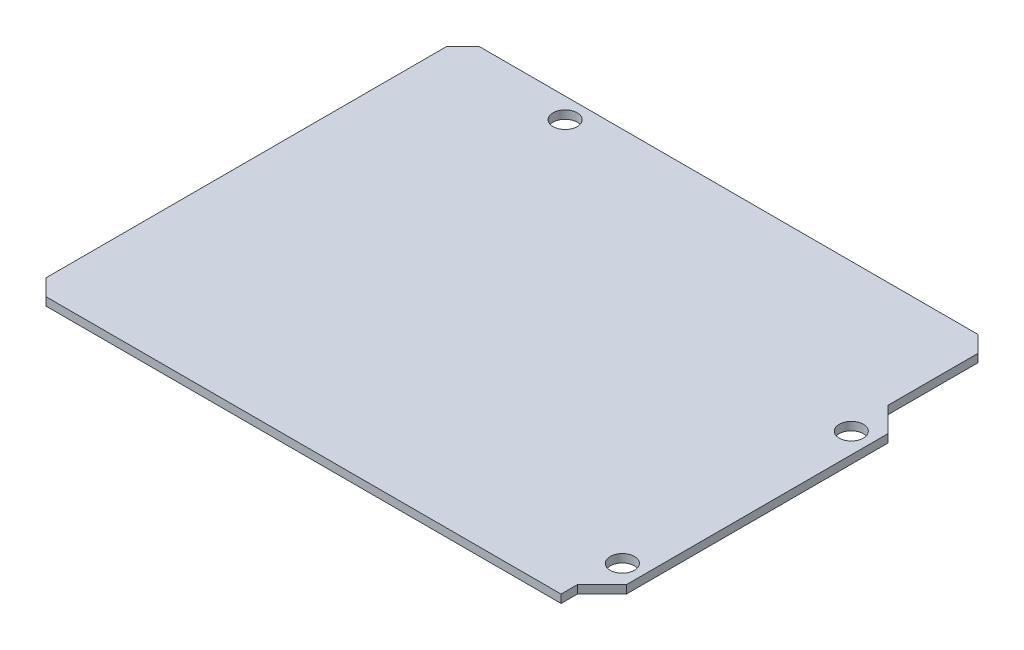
ISO-10303-21;
HEADER;
FILE_DESCRIPTION(('STEP AP214'),'2;1');
FILE_NAME('part.step','',(''),(''),'','','');
FILE_SCHEMA(('AUTOMOTIVE_DESIGN { 1 0 10303 214 1 1 1 1 }'));
ENDSEC;
DATA;
#1=APPLICATION_CONTEXT('core data for automotive mechanical design processes');
#2=APPLICATION_PROTOCOL_DEFINITION('international standard','automotive_design',2000,#1);
#3=PRODUCT_CONTEXT('',#1,'mechanical');
#4=PRODUCT('Part','Part','',(#3));
#5=PRODUCT_RELATED_PRODUCT_CATEGORY('part','',(#4));
#6=PRODUCT_DEFINITION_FORMATION('','',#4);
#7=PRODUCT_DEFINITION_CONTEXT('part definition',#1,'design');
#8=PRODUCT_DEFINITION('design','',#6,#7);
#9=PRODUCT_DEFINITION_SHAPE('','',#8);
#10=(LENGTH_UNIT() NAMED_UNIT(*) SI_UNIT(.MILLI.,.METRE.));
#11=(NAMED_UNIT(*) PLANE_ANGLE_UNIT() SI_UNIT($,.RADIAN.));
#12=(NAMED_UNIT(*) SI_UNIT($,.STERADIAN.) SOLID_ANGLE_UNIT());
#13=UNCERTAINTY_MEASURE_WITH_UNIT(LENGTH_MEASURE(1.E-05),#10,'distance_accuracy_value','');
#14=(GEOMETRIC_REPRESENTATION_CONTEXT(3) GLOBAL_UNCERTAINTY_ASSIGNED_CONTEXT((#13)) GLOBAL_UNIT_ASSIGNED_CONTEXT((#10,
#11,#12)) REPRESENTATION_CONTEXT('',''));
#15=CARTESIAN_POINT('',(0.,0.,0.));
#16=DIRECTION('',(0.,0.,1.));
#17=DIRECTION('',(1.,0.,0.));
#18=AXIS2_PLACEMENT_3D('',#15,#16,#17);
#19=CARTESIAN_POINT('',(-34.,1.,-26.5));
#20=DIRECTION('',(1.,0.,0.));
#21=DIRECTION('',(0.,0.,-1.));
#22=AXIS2_PLACEMENT_3D('',#19,#20,#21);
#23=PLANE('',#22);
#24=DIRECTION('',(0.,0.,1.));
#25=VECTOR('',#24,1.);
#26=CARTESIAN_POINT('',(-34.,0.,-26.5));
#27=LINE('',#26,#25);
#28=CARTESIAN_POINT('',(-34.,0.,-24.5));
#29=VERTEX_POINT('',#28);
#30=CARTESIAN_POINT('',(-34.,0.,24.5));
#31=VERTEX_POINT('',#30);
#32=EDGE_CURVE('E164',#29,#31,#27,.T.);
#33=ORIENTED_EDGE('',*,*,#32,.T.);
#34=DIRECTION('',(0.,1.,0.));
#35=VECTOR('',#34,1.);
#36=CARTESIAN_POINT('',(-34.,1.,24.5));
#37=LINE('',#36,#35);
#38=CARTESIAN_POINT('',(-34.,1.,24.5));
#39=VERTEX_POINT('',#38);
#40=EDGE_CURVE('E193',#31,#39,#37,.T.);
#41=ORIENTED_EDGE('',*,*,#40,.T.);
#42=DIRECTION('',(0.,0.,1.));
#43=VECTOR('',#42,1.);
#44=CARTESIAN_POINT('',(-34.,1.,-26.5));
#45=LINE('',#44,#43);
#46=CARTESIAN_POINT('',(-34.,1.,-24.5));
#47=VERTEX_POINT('',#46);
#48=EDGE_CURVE('E165',#47,#39,#45,.T.);
#49=ORIENTED_EDGE('',*,*,#48,.F.);
#50=DIRECTION('',(0.,-1.,0.));
#51=VECTOR('',#50,1.);
#52=CARTESIAN_POINT('',(-34.,1.,-24.5));
#53=LINE('',#52,#51);
#54=EDGE_CURVE('E190',#47,#29,#53,.T.);
#55=ORIENTED_EDGE('',*,*,#54,.T.);
#56=EDGE_LOOP('',(#33,#41,#49,#55));
#57=FACE_BOUND('',#56,.T.);
#58=ADVANCED_FACE('F38',(#57),#23,.F.);
#59=CARTESIAN_POINT('',(-34.,1.,26.5));
#60=DIRECTION('',(0.,0.,-1.));
#61=DIRECTION('',(-1.,0.,0.));
#62=AXIS2_PLACEMENT_3D('',#59,#60,#61);
#63=PLANE('',#62);
#64=DIRECTION('',(1.,0.,0.));
#65=VECTOR('',#64,1.);
#66=CARTESIAN_POINT('',(-34.,1.,26.5));
#67=LINE('',#66,#65);
#68=CARTESIAN_POINT('',(-32.,1.,26.5));
#69=VERTEX_POINT('',#68);
#70=CARTESIAN_POINT('',(31.,1.,26.5));
#71=VERTEX_POINT('',#70);
#72=EDGE_CURVE('E167',#69,#71,#67,.T.);
#73=ORIENTED_EDGE('',*,*,#72,.F.);
#74=DIRECTION('',(0.,-1.,0.));
#75=VECTOR('',#74,1.);
#76=CARTESIAN_POINT('',(-32.,1.,26.5));
#77=LINE('',#76,#75);
#78=CARTESIAN_POINT('',(-32.,0.,26.5));
#79=VERTEX_POINT('',#78);
#80=EDGE_CURVE('E173',#69,#79,#77,.T.);
#81=ORIENTED_EDGE('',*,*,#80,.T.);
#82=DIRECTION('',(1.,0.,0.));
#83=VECTOR('',#82,1.);
#84=CARTESIAN_POINT('',(-34.,0.,26.5));
#85=LINE('',#84,#83);
#86=CARTESIAN_POINT('',(31.,0.,26.5));
#87=VERTEX_POINT('',#86);
#88=EDGE_CURVE('E176',#79,#87,#85,.T.);
#89=ORIENTED_EDGE('',*,*,#88,.T.);
#90=DIRECTION('',(0.,1.,0.));
#91=VECTOR('',#90,1.);
#92=CARTESIAN_POINT('',(31.,-0.000999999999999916,26.5));
#93=LINE('',#92,#91);
#94=EDGE_CURVE('E156',#87,#71,#93,.T.);
#95=ORIENTED_EDGE('',*,*,#94,.T.);
#96=EDGE_LOOP('',(#73,#81,#89,#95));
#97=FACE_BOUND('',#96,.T.);
#98=ADVANCED_FACE('F223',(#97),#63,.F.);
#99=CARTESIAN_POINT('',(34.,1.,-26.5));
#100=DIRECTION('',(-1.,0.,0.));
#101=DIRECTION('',(0.,0.,1.));
#102=AXIS2_PLACEMENT_3D('',#99,#100,#101);
#103=PLANE('',#102);
#104=DIRECTION('',(0.,0.,-1.));
#105=VECTOR('',#104,1.);
#106=CARTESIAN_POINT('',(34.,0.,-26.5));
#107=LINE('',#106,#105);
#108=CARTESIAN_POINT('',(34.,0.,21.5));
#109=VERTEX_POINT('',#108);
#110=CARTESIAN_POINT('',(34.,0.,-10.5));
#111=VERTEX_POINT('',#110);
#112=EDGE_CURVE('E178',#109,#111,#107,.T.);
#113=ORIENTED_EDGE('',*,*,#112,.T.);
#114=DIRECTION('',(0.,1.,0.));
#115=VECTOR('',#114,1.);
#116=CARTESIAN_POINT('',(34.,-0.000999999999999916,-10.5));
#117=LINE('',#116,#115);
#118=CARTESIAN_POINT('',(34.,1.,-10.5));
#119=VERTEX_POINT('',#118);
#120=EDGE_CURVE('E135',#111,#119,#117,.T.);
#121=ORIENTED_EDGE('',*,*,#120,.T.);
#122=DIRECTION('',(0.,0.,-1.));
#123=VECTOR('',#122,1.);
#124=CARTESIAN_POINT('',(34.,1.,-26.5));
#125=LINE('',#124,#123);
#126=CARTESIAN_POINT('',(34.,1.,21.5));
#127=VERTEX_POINT('',#126);
#128=EDGE_CURVE('E142',#127,#119,#125,.T.);
#129=ORIENTED_EDGE('',*,*,#128,.F.);
#130=DIRECTION('',(0.,1.,0.));
#131=VECTOR('',#130,1.);
#132=CARTESIAN_POINT('',(34.,-0.000999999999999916,21.5));
#133=LINE('',#132,#131);
#134=EDGE_CURVE('E155',#109,#127,#133,.T.);
#135=ORIENTED_EDGE('',*,*,#134,.F.);
#136=EDGE_LOOP('',(#113,#121,#129,#135));
#137=FACE_BOUND('',#136,.T.);
#138=ADVANCED_FACE('F229',(#137),#103,.F.);
#139=CARTESIAN_POINT('',(-34.,1.,-26.5));
#140=DIRECTION('',(0.,0.,1.));
#141=DIRECTION('',(1.,0.,0.));
#142=AXIS2_PLACEMENT_3D('',#139,#140,#141);
#143=PLANE('',#142);
#144=DIRECTION('',(-1.,0.,0.));
#145=VECTOR('',#144,1.);
#146=CARTESIAN_POINT('',(-34.,0.,-26.5));
#147=LINE('',#146,#145);
#148=CARTESIAN_POINT('',(29.,0.,-26.5));
#149=VERTEX_POINT('',#148);
#150=CARTESIAN_POINT('',(-32.,0.,-26.5));
#151=VERTEX_POINT('',#150);
#152=EDGE_CURVE('E168',#149,#151,#147,.T.);
#153=ORIENTED_EDGE('',*,*,#152,.T.);
#154=DIRECTION('',(0.,1.,0.));
#155=VECTOR('',#154,1.);
#156=CARTESIAN_POINT('',(-32.,1.,-26.5));
#157=LINE('',#156,#155);
#158=CARTESIAN_POINT('',(-32.,1.,-26.5));
#159=VERTEX_POINT('',#158);
#160=EDGE_CURVE('E46',#151,#159,#157,.T.);
#161=ORIENTED_EDGE('',*,*,#160,.T.);
#162=DIRECTION('',(-1.,0.,0.));
#163=VECTOR('',#162,1.);
#164=CARTESIAN_POINT('',(-34.,1.,-26.5));
#165=LINE('',#164,#163);
#166=CARTESIAN_POINT('',(29.,1.,-26.5));
#167=VERTEX_POINT('',#166);
#168=EDGE_CURVE('E171',#167,#159,#165,.T.);
#169=ORIENTED_EDGE('',*,*,#168,.F.);
#170=DIRECTION('',(0.,-1.,0.));
#171=VECTOR('',#170,1.);
#172=CARTESIAN_POINT('',(29.,1.,-26.5));
#173=LINE('',#172,#171);
#174=EDGE_CURVE('E200',#167,#149,#173,.T.);
#175=ORIENTED_EDGE('',*,*,#174,.T.);
#176=EDGE_LOOP('',(#153,#161,#169,#175));
#177=FACE_BOUND('',#176,.T.);
#178=ADVANCED_FACE('F203',(#177),#143,.F.);
#179=CARTESIAN_POINT('',(-34.,1.,26.5));
#180=DIRECTION('',(0.,1.,0.));
#181=DIRECTION('',(0.,0.,1.));
#182=AXIS2_PLACEMENT_3D('',#179,#180,#181);
#183=PLANE('',#182);
#184=CARTESIAN_POINT('',(31.5,1.,19.5));
#185=DIRECTION('',(0.,1.,0.));
#186=DIRECTION('',(0.,0.,1.));
#187=AXIS2_PLACEMENT_3D('',#184,#185,#186);
#188=CIRCLE('',#187,1.47319999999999);
#189=CARTESIAN_POINT('',(31.5,1.,20.9732));
#190=VERTEX_POINT('',#189);
#191=EDGE_CURVE('E275',#190,#190,#188,.T.);
#192=ORIENTED_EDGE('',*,*,#191,.F.);
#193=EDGE_LOOP('',(#192));
#194=FACE_BOUND('',#193,.T.);
#195=CARTESIAN_POINT('',(31.5,1.,-8.50000000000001));
#196=DIRECTION('',(0.,1.,0.));
#197=DIRECTION('',(0.,0.,1.));
#198=AXIS2_PLACEMENT_3D('',#195,#196,#197);
#199=CIRCLE('',#198,1.47319999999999);
#200=CARTESIAN_POINT('',(31.5,1.,-7.02680000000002));
#201=VERTEX_POINT('',#200);
#202=EDGE_CURVE('E269',#201,#201,#199,.T.);
#203=ORIENTED_EDGE('',*,*,#202,.F.);
#204=EDGE_LOOP('',(#203));
#205=FACE_BOUND('',#204,.T.);
#206=CARTESIAN_POINT('',(-19.,1.,-24.));
#207=DIRECTION('',(0.,1.,0.));
#208=DIRECTION('',(0.,0.,1.));
#209=AXIS2_PLACEMENT_3D('',#206,#207,#208);
#210=CIRCLE('',#209,1.47319999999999);
#211=CARTESIAN_POINT('',(-19.,1.,-22.5268));
#212=VERTEX_POINT('',#211);
#213=EDGE_CURVE('E263',#212,#212,#210,.T.);
#214=ORIENTED_EDGE('',*,*,#213,.F.);
#215=EDGE_LOOP('',(#214));
#216=FACE_BOUND('',#215,.T.);
#217=ORIENTED_EDGE('',*,*,#48,.T.);
#218=DIRECTION('',(-0.707106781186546,0.,-0.707106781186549));
#219=VECTOR('',#218,1.);
#220=CARTESIAN_POINT('',(-33.,1.,25.5));
#221=LINE('',#220,#219);
#222=EDGE_CURVE('E198',#39,#69,#221,.F.);
#223=ORIENTED_EDGE('',*,*,#222,.T.);
#224=ORIENTED_EDGE('',*,*,#72,.T.);
#225=DIRECTION('',(0.,0.,1.));
#226=VECTOR('',#225,1.);
#227=CARTESIAN_POINT('',(31.,1.,26.5));
#228=LINE('',#227,#226);
#229=CARTESIAN_POINT('',(31.,1.,24.5));
#230=VERTEX_POINT('',#229);
#231=EDGE_CURVE('E152',#230,#71,#228,.T.);
#232=ORIENTED_EDGE('',*,*,#231,.F.);
#233=DIRECTION('',(-0.707106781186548,0.,0.707106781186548));
#234=VECTOR('',#233,1.);
#235=CARTESIAN_POINT('',(34.,1.,21.5));
#236=LINE('',#235,#234);
#237=EDGE_CURVE('E149',#127,#230,#236,.T.);
#238=ORIENTED_EDGE('',*,*,#237,.F.);
#239=ORIENTED_EDGE('',*,*,#128,.T.);
#240=DIRECTION('',(0.707106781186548,0.,0.707106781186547));
#241=VECTOR('',#240,1.);
#242=CARTESIAN_POINT('',(34.,1.,-10.5));
#243=LINE('',#242,#241);
#244=CARTESIAN_POINT('',(31.,1.,-13.5));
#245=VERTEX_POINT('',#244);
#246=EDGE_CURVE('E128',#245,#119,#243,.T.);
#247=ORIENTED_EDGE('',*,*,#246,.F.);
#248=DIRECTION('',(0.,0.,1.));
#249=VECTOR('',#248,1.);
#250=CARTESIAN_POINT('',(31.,1.,-26.5));
#251=LINE('',#250,#249);
#252=CARTESIAN_POINT('',(31.,1.,-24.5));
#253=VERTEX_POINT('',#252);
#254=EDGE_CURVE('E120',#253,#245,#251,.T.);
#255=ORIENTED_EDGE('',*,*,#254,.F.);
#256=DIRECTION('',(0.707106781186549,0.,0.707106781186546));
#257=VECTOR('',#256,1.);
#258=CARTESIAN_POINT('',(23.9999999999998,1.,-31.5000000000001));
#259=LINE('',#258,#257);
#260=EDGE_CURVE('E59',#253,#167,#259,.F.);
#261=ORIENTED_EDGE('',*,*,#260,.T.);
#262=ORIENTED_EDGE('',*,*,#168,.T.);
#263=DIRECTION('',(0.707106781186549,0.,-0.707106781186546));
#264=VECTOR('',#263,1.);
#265=CARTESIAN_POINT('',(-59.5,1.,0.999999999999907));
#266=LINE('',#265,#264);
#267=EDGE_CURVE('E196',#159,#47,#266,.F.);
#268=ORIENTED_EDGE('',*,*,#267,.T.);
#269=EDGE_LOOP('',(#217,#223,#224,#232,#238,#239,#247,#255,#261,#262,#268));
#270=FACE_BOUND('',#269,.T.);
#271=ADVANCED_FACE('F139',(#194,#205,#216,#270),#183,.T.);
#272=CARTESIAN_POINT('',(-34.,0.,26.5));
#273=DIRECTION('',(0.,1.,0.));
#274=DIRECTION('',(0.,0.,1.));
#275=AXIS2_PLACEMENT_3D('',#272,#273,#274);
#276=PLANE('',#275);
#277=CARTESIAN_POINT('',(31.5,0.,19.5));
#278=DIRECTION('',(0.,1.,0.));
#279=DIRECTION('',(0.,0.,1.));
#280=AXIS2_PLACEMENT_3D('',#277,#278,#279);
#281=CIRCLE('',#280,1.47319999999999);
#282=CARTESIAN_POINT('',(31.5,0.,20.9732));
#283=VERTEX_POINT('',#282);
#284=EDGE_CURVE('E272',#283,#283,#281,.T.);
#285=ORIENTED_EDGE('',*,*,#284,.T.);
#286=EDGE_LOOP('',(#285));
#287=FACE_BOUND('',#286,.T.);
#288=CARTESIAN_POINT('',(31.5,0.,-8.50000000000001));
#289=DIRECTION('',(0.,1.,0.));
#290=DIRECTION('',(0.,0.,1.));
#291=AXIS2_PLACEMENT_3D('',#288,#289,#290);
#292=CIRCLE('',#291,1.47319999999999);
#293=CARTESIAN_POINT('',(31.5,0.,-7.02680000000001));
#294=VERTEX_POINT('',#293);
#295=EDGE_CURVE('E266',#294,#294,#292,.T.);
#296=ORIENTED_EDGE('',*,*,#295,.T.);
#297=EDGE_LOOP('',(#296));
#298=FACE_BOUND('',#297,.T.);
#299=CARTESIAN_POINT('',(-19.,0.,-24.));
#300=DIRECTION('',(0.,1.,0.));
#301=DIRECTION('',(0.,0.,1.));
#302=AXIS2_PLACEMENT_3D('',#299,#300,#301);
#303=CIRCLE('',#302,1.47319999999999);
#304=CARTESIAN_POINT('',(-19.,0.,-22.5268));
#305=VERTEX_POINT('',#304);
#306=EDGE_CURVE('E258',#305,#305,#303,.T.);
#307=ORIENTED_EDGE('',*,*,#306,.T.);
#308=EDGE_LOOP('',(#307));
#309=FACE_BOUND('',#308,.T.);
#310=ORIENTED_EDGE('',*,*,#88,.F.);
#311=DIRECTION('',(0.707106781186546,0.,0.707106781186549));
#312=VECTOR('',#311,1.);
#313=CARTESIAN_POINT('',(-32.,0.,26.5));
#314=LINE('',#313,#312);
#315=EDGE_CURVE('E188',#79,#31,#314,.F.);
#316=ORIENTED_EDGE('',*,*,#315,.T.);
#317=ORIENTED_EDGE('',*,*,#32,.F.);
#318=DIRECTION('',(-0.707106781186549,0.,0.707106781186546));
#319=VECTOR('',#318,1.);
#320=CARTESIAN_POINT('',(-34.,0.,-24.5));
#321=LINE('',#320,#319);
#322=EDGE_CURVE('E186',#29,#151,#321,.F.);
#323=ORIENTED_EDGE('',*,*,#322,.T.);
#324=ORIENTED_EDGE('',*,*,#152,.F.);
#325=DIRECTION('',(-0.707106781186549,0.,-0.707106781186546));
#326=VECTOR('',#325,1.);
#327=CARTESIAN_POINT('',(31.,0.,-24.5));
#328=LINE('',#327,#326);
#329=CARTESIAN_POINT('',(31.,0.,-24.5));
#330=VERTEX_POINT('',#329);
#331=EDGE_CURVE('E184',#149,#330,#328,.F.);
#332=ORIENTED_EDGE('',*,*,#331,.T.);
#333=DIRECTION('',(0.,0.,-1.));
#334=VECTOR('',#333,1.);
#335=CARTESIAN_POINT('',(31.,0.,-26.5));
#336=LINE('',#335,#334);
#337=CARTESIAN_POINT('',(31.,0.,-13.5));
#338=VERTEX_POINT('',#337);
#339=EDGE_CURVE('E257',#338,#330,#336,.T.);
#340=ORIENTED_EDGE('',*,*,#339,.F.);
#341=DIRECTION('',(-0.707106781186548,0.,-0.707106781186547));
#342=VECTOR('',#341,1.);
#343=CARTESIAN_POINT('',(34.,0.,-10.5));
#344=LINE('',#343,#342);
#345=EDGE_CURVE('E129',#111,#338,#344,.T.);
#346=ORIENTED_EDGE('',*,*,#345,.F.);
#347=ORIENTED_EDGE('',*,*,#112,.F.);
#348=DIRECTION('',(0.707106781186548,0.,-0.707106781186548));
#349=VECTOR('',#348,1.);
#350=CARTESIAN_POINT('',(34.,0.,21.5));
#351=LINE('',#350,#349);
#352=CARTESIAN_POINT('',(31.,0.,24.5));
#353=VERTEX_POINT('',#352);
#354=EDGE_CURVE('E159',#353,#109,#351,.T.);
#355=ORIENTED_EDGE('',*,*,#354,.F.);
#356=DIRECTION('',(0.,0.,-1.));
#357=VECTOR('',#356,1.);
#358=CARTESIAN_POINT('',(31.,0.,26.5));
#359=LINE('',#358,#357);
#360=EDGE_CURVE('E146',#87,#353,#359,.T.);
#361=ORIENTED_EDGE('',*,*,#360,.F.);
#362=EDGE_LOOP('',(#310,#316,#317,#323,#324,#332,#340,#346,#347,#355,#361));
#363=FACE_BOUND('',#362,.T.);
#364=ADVANCED_FACE('F208',(#287,#298,#309,#363),#276,.F.);
#365=CARTESIAN_POINT('',(31.,-0.000999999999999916,26.5));
#366=DIRECTION('',(-1.,0.,0.));
#367=DIRECTION('',(0.,0.,1.));
#368=AXIS2_PLACEMENT_3D('',#365,#366,#367);
#369=PLANE('',#368);
#370=ORIENTED_EDGE('',*,*,#360,.T.);
#371=DIRECTION('',(0.,1.,0.));
#372=VECTOR('',#371,1.);
#373=CARTESIAN_POINT('',(31.,-0.000999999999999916,24.5));
#374=LINE('',#373,#372);
#375=EDGE_CURVE('E160',#353,#230,#374,.T.);
#376=ORIENTED_EDGE('',*,*,#375,.T.);
#377=ORIENTED_EDGE('',*,*,#231,.T.);
#378=ORIENTED_EDGE('',*,*,#94,.F.);
#379=EDGE_LOOP('',(#370,#376,#377,#378));
#380=FACE_BOUND('',#379,.T.);
#381=ADVANCED_FACE('F249',(#380),#369,.F.);
#382=CARTESIAN_POINT('',(34.,-0.000999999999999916,21.5));
#383=DIRECTION('',(-0.707106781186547,0.,-0.707106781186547));
#384=DIRECTION('',(-0.707106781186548,0.,0.707106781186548));
#385=AXIS2_PLACEMENT_3D('',#382,#383,#384);
#386=PLANE('',#385);
#387=ORIENTED_EDGE('',*,*,#354,.T.);
#388=ORIENTED_EDGE('',*,*,#134,.T.);
#389=ORIENTED_EDGE('',*,*,#237,.T.);
#390=ORIENTED_EDGE('',*,*,#375,.F.);
#391=EDGE_LOOP('',(#387,#388,#389,#390));
#392=FACE_BOUND('',#391,.T.);
#393=ADVANCED_FACE('F255',(#392),#386,.F.);
#394=CARTESIAN_POINT('',(34.,-0.000999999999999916,-10.5));
#395=DIRECTION('',(-0.707106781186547,0.,0.707106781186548));
#396=DIRECTION('',(0.707106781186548,0.,0.707106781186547));
#397=AXIS2_PLACEMENT_3D('',#394,#395,#396);
#398=PLANE('',#397);
#399=ORIENTED_EDGE('',*,*,#345,.T.);
#400=DIRECTION('',(0.,1.,0.));
#401=VECTOR('',#400,1.);
#402=CARTESIAN_POINT('',(31.,-0.000999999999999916,-13.5));
#403=LINE('',#402,#401);
#404=EDGE_CURVE('E124',#338,#245,#403,.T.);
#405=ORIENTED_EDGE('',*,*,#404,.T.);
#406=ORIENTED_EDGE('',*,*,#246,.T.);
#407=ORIENTED_EDGE('',*,*,#120,.F.);
#408=EDGE_LOOP('',(#399,#405,#406,#407));
#409=FACE_BOUND('',#408,.T.);
#410=ADVANCED_FACE('F132',(#409),#398,.F.);
#411=CARTESIAN_POINT('',(31.,-0.000999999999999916,-26.5));
#412=DIRECTION('',(-1.,0.,0.));
#413=DIRECTION('',(0.,0.,1.));
#414=AXIS2_PLACEMENT_3D('',#411,#412,#413);
#415=PLANE('',#414);
#416=ORIENTED_EDGE('',*,*,#339,.T.);
#417=DIRECTION('',(0.,1.,0.));
#418=VECTOR('',#417,1.);
#419=CARTESIAN_POINT('',(31.,-0.000999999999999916,-24.5));
#420=LINE('',#419,#418);
#421=EDGE_CURVE('E11',#330,#253,#420,.T.);
#422=ORIENTED_EDGE('',*,*,#421,.T.);
#423=ORIENTED_EDGE('',*,*,#254,.T.);
#424=ORIENTED_EDGE('',*,*,#404,.F.);
#425=EDGE_LOOP('',(#416,#422,#423,#424));
#426=FACE_BOUND('',#425,.T.);
#427=ADVANCED_FACE('F123',(#426),#415,.F.);
#428=CARTESIAN_POINT('',(-32.,1.,26.5));
#429=DIRECTION('',(0.707106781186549,0.,-0.707106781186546));
#430=DIRECTION('',(-0.707106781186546,0.,-0.707106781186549));
#431=AXIS2_PLACEMENT_3D('',#428,#429,#430);
#432=PLANE('',#431);
#433=ORIENTED_EDGE('',*,*,#222,.F.);
#434=ORIENTED_EDGE('',*,*,#40,.F.);
#435=ORIENTED_EDGE('',*,*,#315,.F.);
#436=ORIENTED_EDGE('',*,*,#80,.F.);
#437=EDGE_LOOP('',(#433,#434,#435,#436));
#438=FACE_BOUND('',#437,.T.);
#439=ADVANCED_FACE('F220',(#438),#432,.F.);
#440=CARTESIAN_POINT('',(-34.,1.,-24.5));
#441=DIRECTION('',(0.707106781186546,0.,0.707106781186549));
#442=DIRECTION('',(0.707106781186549,0.,-0.707106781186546));
#443=AXIS2_PLACEMENT_3D('',#440,#441,#442);
#444=PLANE('',#443);
#445=ORIENTED_EDGE('',*,*,#267,.F.);
#446=ORIENTED_EDGE('',*,*,#160,.F.);
#447=ORIENTED_EDGE('',*,*,#322,.F.);
#448=ORIENTED_EDGE('',*,*,#54,.F.);
#449=EDGE_LOOP('',(#445,#446,#447,#448));
#450=FACE_BOUND('',#449,.T.);
#451=ADVANCED_FACE('F212',(#450),#444,.F.);
#452=CARTESIAN_POINT('',(31.,-0.000999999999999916,-24.5));
#453=DIRECTION('',(-0.707106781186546,0.,0.707106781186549));
#454=DIRECTION('',(0.707106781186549,0.,0.707106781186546));
#455=AXIS2_PLACEMENT_3D('',#452,#453,#454);
#456=PLANE('',#455);
#457=ORIENTED_EDGE('',*,*,#331,.F.);
#458=ORIENTED_EDGE('',*,*,#174,.F.);
#459=ORIENTED_EDGE('',*,*,#260,.F.);
#460=ORIENTED_EDGE('',*,*,#421,.F.);
#461=EDGE_LOOP('',(#457,#458,#459,#460));
#462=FACE_BOUND('',#461,.T.);
#463=ADVANCED_FACE('F40',(#462),#456,.F.);
#464=CARTESIAN_POINT('',(-19.,1.,-24.));
#465=DIRECTION('',(0.,1.,0.));
#466=DIRECTION('',(0.,0.,1.));
#467=AXIS2_PLACEMENT_3D('',#464,#465,#466);
#468=CYLINDRICAL_SURFACE('',#467,1.47319999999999);
#469=ORIENTED_EDGE('',*,*,#306,.F.);
#470=EDGE_LOOP('',(#469));
#471=FACE_BOUND('',#470,.T.);
#472=ORIENTED_EDGE('',*,*,#213,.T.);
#473=EDGE_LOOP('',(#472));
#474=FACE_BOUND('',#473,.T.);
#475=ADVANCED_FACE('F211',(#471,#474),#468,.F.);
#476=CARTESIAN_POINT('',(31.5,1.,-8.50000000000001));
#477=DIRECTION('',(0.,1.,0.));
#478=DIRECTION('',(0.,0.,1.));
#479=AXIS2_PLACEMENT_3D('',#476,#477,#478);
#480=CYLINDRICAL_SURFACE('',#479,1.47319999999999);
#481=ORIENTED_EDGE('',*,*,#295,.F.);
#482=EDGE_LOOP('',(#481));
#483=FACE_BOUND('',#482,.T.);
#484=ORIENTED_EDGE('',*,*,#202,.T.);
#485=EDGE_LOOP('',(#484));
#486=FACE_BOUND('',#485,.T.);
#487=ADVANCED_FACE('F217',(#483,#486),#480,.F.);
#488=CARTESIAN_POINT('',(31.5,1.,19.5));
#489=DIRECTION('',(0.,1.,0.));
#490=DIRECTION('',(0.,0.,1.));
#491=AXIS2_PLACEMENT_3D('',#488,#489,#490);
#492=CYLINDRICAL_SURFACE('',#491,1.47319999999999);
#493=ORIENTED_EDGE('',*,*,#284,.F.);
#494=EDGE_LOOP('',(#493));
#495=FACE_BOUND('',#494,.T.);
#496=ORIENTED_EDGE('',*,*,#191,.T.);
#497=EDGE_LOOP('',(#496));
#498=FACE_BOUND('',#497,.T.);
#499=ADVANCED_FACE('F279',(#495,#498),#492,.F.);
#500=CLOSED_SHELL('',(#58,#98,#138,#178,#271,#364,#381,#393,#410,#427,#439,#451,#463,#475,#487,#499));
#501=MANIFOLD_SOLID_BREP('B2',#500);
#502=ADVANCED_BREP_SHAPE_REPRESENTATION('',(#18,#501),#14);
#503=SHAPE_DEFINITION_REPRESENTATION(#9,#502);
ENDSEC;
END-ISO-10303-21;
